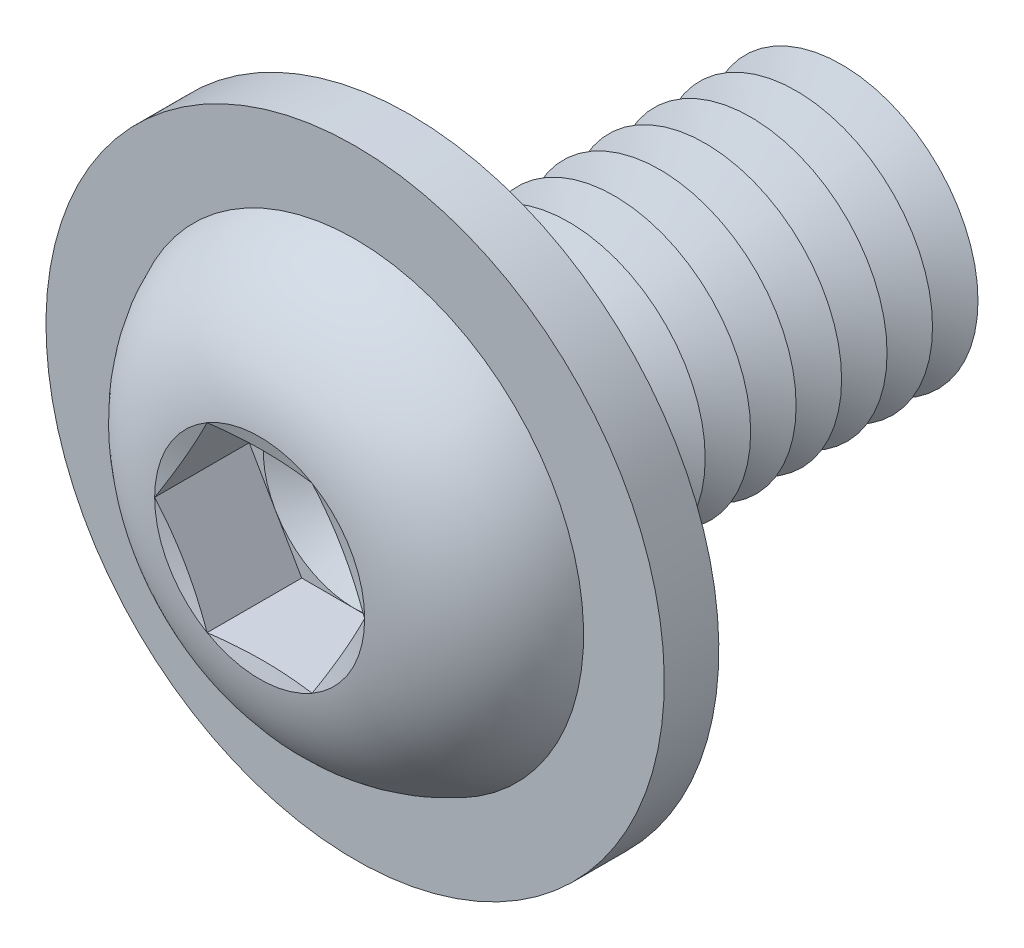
from build123d import *

# Parameters (mm, degrees)
FILLET1_R           = 0.5
LPATTERN1_COUNT     = 10
LPATTERN1_PITCH     = 1
CUT_EXTRUDE1_DEPTH  = 2.08
SKETCH5_R           = 6.8
SKETCH5_R_2         = 3.5
BOSS_EXTRUDE1_DEPTH = 1.2


with BuildPart() as part:
    # Sketch1 → Revolve1 (revolve)
    with BuildSketch(Plane(origin=(0, 0, 0), x_dir=(0, 0, -1), z_dir=(1, 0, 0)), mode=Mode.PRIVATE) as revolve1_sk:
        with BuildLine():
            Line((0, 3), (0, 5.25))
            ThreePointArc((0, 5.25), (-2.210041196, 4.408189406), (-3.3, 2.3094))
            Line((-3.3, 2.3094), (-2.990599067, 1.1547))
            Line((-2.990599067, 1.1547), (-3.3, 1.1547))
            Line((-3.3, 1.1547), (-3.3, 0))
            Line((-3.3, 0), (10, 0))
            Line((10, 0), (10, 3))
            Line((10, 3), (0, 3))
        make_face()
    revolve(revolve1_sk.sketch.rotate(Axis((0, 0, -10), (0, 0, 1)), 90), axis=Axis((0, 0, -10), (0, 0, 1)))

    # Fillet1
    fillet1_edges = [part.edges().sort_by_distance(p)[0] for p in [
        (3, 0, 0),
    ]]
    fillet(fillet1_edges, radius=FILLET1_R)

    # Sketch2 → Cut-Revolve1 (revolve, cut)
    with BuildSketch(Plane(origin=(0, 0, 0), x_dir=(0, 0, -1), z_dir=(1, 0, 0)), mode=Mode.PRIVATE) as cut_revolve1_sk:
        Polygon((9.5, 3), (10.5, 3), (10, 2.133974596), align=None)
    cut_revolve1 = revolve(cut_revolve1_sk.sketch.rotate(Axis((0, 0, -10), (0, 0, -1)), 270), axis=Axis((0, 0, -10), (0, 0, -1)), mode=Mode.SUBTRACT)

    # LPattern1: Cut-Revolve1 ×10
    with Locations(*[(0, 0, i * LPATTERN1_PITCH) for i in range(1, LPATTERN1_COUNT)]):
        add(cut_revolve1, mode=Mode.SUBTRACT)

    # Sketch3 → Cut-Extrude1 (cut)
    with BuildSketch(Plane.XY.offset(3.3)):
        Polygon((1.1547, 1.999999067), (-1.1547, 1.999999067), (-2.3094, 0), (-1.1547, -1.999999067), (1.1547, -1.999999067), (2.3094, 0), align=None)
    extrude(amount=-CUT_EXTRUDE1_DEPTH, mode=Mode.SUBTRACT)

    # Cut-Extrude2 cone 1 section (on through the dimple's axis) → Cut-Extrude2 (revolve, cut)
    with BuildSketch(Plane(origin=(0, 0, 1.22), x_dir=(0, -1, 0), z_dir=(1, 0, 0))):
        Polygon((0, 0), (1.999999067, 0), (0, 1.1547), align=None)
    revolve(axis=Axis((0, 0, 1.22), (0, 0, -1)), mode=Mode.SUBTRACT)

    # Sketch5 → Boss-Extrude1 (add)
    with BuildSketch(Plane(origin=(0, 0, 0), x_dir=(-1, 0, 0), z_dir=(0, 0, -1))):
        with Locations(Location((0, 0, 0), (0, 0, 90))):
            Circle(SKETCH5_R)
        Circle(SKETCH5_R_2, mode=Mode.SUBTRACT)
    extrude(amount=-BOSS_EXTRUDE1_DEPTH)


solid = part.part
